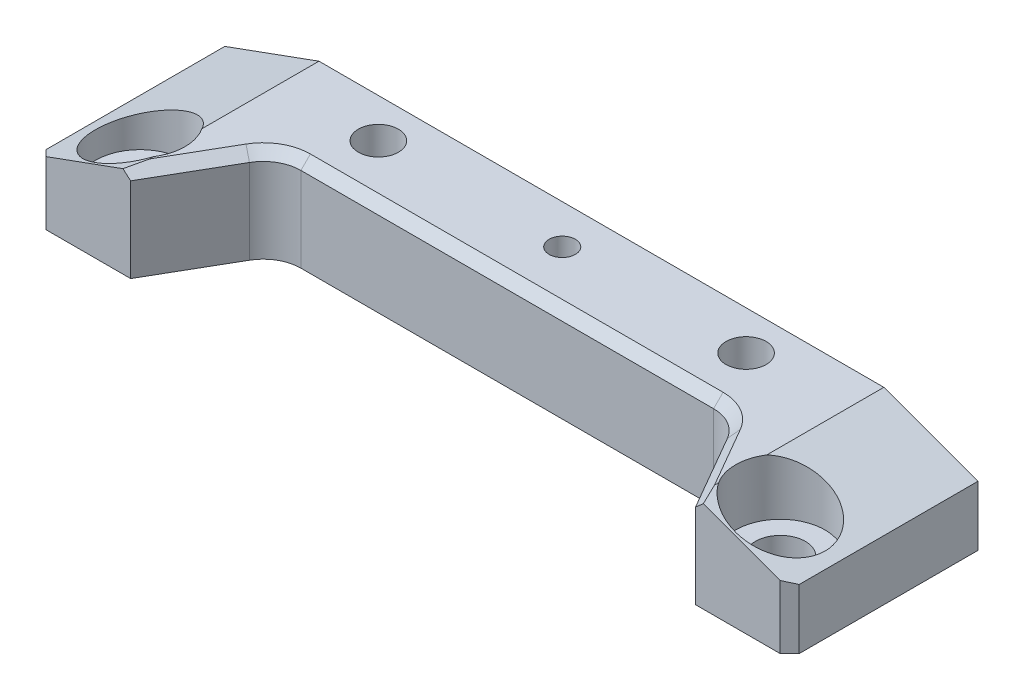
ISO-10303-21;
HEADER;
FILE_DESCRIPTION(('STEP AP214'),'2;1');
FILE_NAME('part.step','',(''),(''),'','','');
FILE_SCHEMA(('AUTOMOTIVE_DESIGN { 1 0 10303 214 1 1 1 1 }'));
ENDSEC;
DATA;
#1=APPLICATION_CONTEXT('core data for automotive mechanical design processes');
#2=APPLICATION_PROTOCOL_DEFINITION('international standard','automotive_design',2000,#1);
#3=PRODUCT_CONTEXT('',#1,'mechanical');
#4=PRODUCT('Part','Part','',(#3));
#5=PRODUCT_RELATED_PRODUCT_CATEGORY('part','',(#4));
#6=PRODUCT_DEFINITION_FORMATION('','',#4);
#7=PRODUCT_DEFINITION_CONTEXT('part definition',#1,'design');
#8=PRODUCT_DEFINITION('design','',#6,#7);
#9=PRODUCT_DEFINITION_SHAPE('','',#8);
#10=(LENGTH_UNIT() NAMED_UNIT(*) SI_UNIT(.MILLI.,.METRE.));
#11=(NAMED_UNIT(*) PLANE_ANGLE_UNIT() SI_UNIT($,.RADIAN.));
#12=(NAMED_UNIT(*) SI_UNIT($,.STERADIAN.) SOLID_ANGLE_UNIT());
#13=UNCERTAINTY_MEASURE_WITH_UNIT(LENGTH_MEASURE(1.E-05),#10,'distance_accuracy_value','');
#14=(GEOMETRIC_REPRESENTATION_CONTEXT(3) GLOBAL_UNCERTAINTY_ASSIGNED_CONTEXT((#13)) GLOBAL_UNIT_ASSIGNED_CONTEXT((#10,
#11,#12)) REPRESENTATION_CONTEXT('',''));
#15=CARTESIAN_POINT('',(0.,0.,0.));
#16=DIRECTION('',(0.,0.,1.));
#17=DIRECTION('',(1.,0.,0.));
#18=AXIS2_PLACEMENT_3D('',#15,#16,#17);
#19=CARTESIAN_POINT('',(0.,9.525,0.));
#20=DIRECTION('',(0.,1.,0.));
#21=DIRECTION('',(0.,0.,1.));
#22=AXIS2_PLACEMENT_3D('',#19,#20,#21);
#23=PLANE('',#22);
#24=CARTESIAN_POINT('',(0.,9.525,0.));
#25=DIRECTION('',(0.,1.,0.));
#26=DIRECTION('',(0.,0.,1.));
#27=AXIS2_PLACEMENT_3D('',#24,#25,#26);
#28=CIRCLE('',#27,2.21386533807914);
#29=CARTESIAN_POINT('',(0.,9.525,2.21386533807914));
#30=VERTEX_POINT('',#29);
#31=EDGE_CURVE('E19',#30,#30,#28,.T.);
#32=ORIENTED_EDGE('',*,*,#31,.T.);
#33=EDGE_LOOP('',(#32));
#34=FACE_BOUND('',#33,.T.);
#35=ADVANCED_FACE('F16',(#34),#23,.T.);
#36=CARTESIAN_POINT('',(0.,9.525,0.));
#37=DIRECTION('',(0.,1.,0.));
#38=DIRECTION('',(0.,0.,1.));
#39=AXIS2_PLACEMENT_3D('',#36,#37,#38);
#40=CYLINDRICAL_SURFACE('',#39,2.21386533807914);
#41=CARTESIAN_POINT('',(0.,15.875,0.));
#42=DIRECTION('',(0.,1.,0.));
#43=DIRECTION('',(0.,0.,1.));
#44=AXIS2_PLACEMENT_3D('',#41,#42,#43);
#45=CIRCLE('',#44,2.21386533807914);
#46=CARTESIAN_POINT('',(0.,15.875,2.21386533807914));
#47=VERTEX_POINT('',#46);
#48=EDGE_CURVE('E331',#47,#47,#45,.F.);
#49=ORIENTED_EDGE('',*,*,#48,.F.);
#50=EDGE_LOOP('',(#49));
#51=FACE_BOUND('',#50,.T.);
#52=ORIENTED_EDGE('',*,*,#31,.F.);
#53=EDGE_LOOP('',(#52));
#54=FACE_BOUND('',#53,.T.);
#55=ADVANCED_FACE('F585',(#51,#54),#40,.F.);
#56=CARTESIAN_POINT('',(-53.975,15.875,17.1958));
#57=DIRECTION('',(0.,1.,0.));
#58=DIRECTION('',(0.,0.,1.));
#59=AXIS2_PLACEMENT_3D('',#56,#57,#58);
#60=CYLINDRICAL_SURFACE('',#59,7.5438);
#61=CARTESIAN_POINT('',(-53.975,6.35,17.1958));
#62=DIRECTION('',(0.,1.,0.));
#63=DIRECTION('',(0.,0.,1.));
#64=AXIS2_PLACEMENT_3D('',#61,#62,#63);
#65=CIRCLE('',#64,7.5438);
#66=CARTESIAN_POINT('',(-53.975,6.35,24.7396));
#67=VERTEX_POINT('',#66);
#68=EDGE_CURVE('E328',#67,#67,#65,.F.);
#69=ORIENTED_EDGE('',*,*,#68,.T.);
#70=EDGE_LOOP('',(#69));
#71=FACE_BOUND('',#70,.T.);
#72=CARTESIAN_POINT('',(-53.975,15.875,17.1958));
#73=DIRECTION('',(0.,1.,0.));
#74=DIRECTION('',(0.,0.,1.));
#75=AXIS2_PLACEMENT_3D('',#72,#73,#74);
#76=CIRCLE('',#75,7.5438);
#77=CARTESIAN_POINT('',(-47.625,15.875,13.1231573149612));
#78=VERTEX_POINT('',#77);
#79=CARTESIAN_POINT('',(-47.625,15.875,21.2684426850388));
#80=VERTEX_POINT('',#79);
#81=EDGE_CURVE('E157',#78,#80,#76,.F.);
#82=ORIENTED_EDGE('',*,*,#81,.F.);
#83=CARTESIAN_POINT('',(-53.975,13.5637890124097,17.1958));
#84=DIRECTION('',(0.342020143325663,-0.93969262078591,0.));
#85=DIRECTION('',(0.93969262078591,0.342020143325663,0.));
#86=AXIS2_PLACEMENT_3D('',#83,#84,#85);
#87=ELLIPSE('',#86,8.02794428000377,7.5438);
#88=EDGE_CURVE('E145',#78,#80,#87,.F.);
#89=ORIENTED_EDGE('',*,*,#88,.T.);
#90=EDGE_LOOP('',(#82,#89));
#91=FACE_BOUND('',#90,.T.);
#92=ADVANCED_FACE('F158',(#71,#91),#60,.F.);
#93=CARTESIAN_POINT('',(53.975,15.875,17.1958));
#94=DIRECTION('',(0.,1.,0.));
#95=DIRECTION('',(0.,0.,1.));
#96=AXIS2_PLACEMENT_3D('',#93,#94,#95);
#97=CYLINDRICAL_SURFACE('',#96,7.5438);
#98=CARTESIAN_POINT('',(53.975,6.35,17.1958));
#99=DIRECTION('',(0.,1.,0.));
#100=DIRECTION('',(0.,0.,1.));
#101=AXIS2_PLACEMENT_3D('',#98,#99,#100);
#102=CIRCLE('',#101,7.5438);
#103=CARTESIAN_POINT('',(53.975,6.35,24.7396));
#104=VERTEX_POINT('',#103);
#105=EDGE_CURVE('E325',#104,#104,#102,.F.);
#106=ORIENTED_EDGE('',*,*,#105,.T.);
#107=EDGE_LOOP('',(#106));
#108=FACE_BOUND('',#107,.T.);
#109=CARTESIAN_POINT('',(53.975,15.875,17.1958));
#110=DIRECTION('',(0.,1.,0.));
#111=DIRECTION('',(0.,0.,1.));
#112=AXIS2_PLACEMENT_3D('',#109,#110,#111);
#113=CIRCLE('',#112,7.5438);
#114=CARTESIAN_POINT('',(47.625,15.875,21.2684426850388));
#115=VERTEX_POINT('',#114);
#116=CARTESIAN_POINT('',(47.625,15.875,13.1231573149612));
#117=VERTEX_POINT('',#116);
#118=EDGE_CURVE('E169',#115,#117,#113,.F.);
#119=ORIENTED_EDGE('',*,*,#118,.F.);
#120=CARTESIAN_POINT('',(53.975,13.5637890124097,17.1958));
#121=DIRECTION('',(-0.342020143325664,-0.93969262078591,0.));
#122=DIRECTION('',(-0.93969262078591,0.342020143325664,0.));
#123=AXIS2_PLACEMENT_3D('',#120,#121,#122);
#124=ELLIPSE('',#123,8.02794428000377,7.5438);
#125=EDGE_CURVE('E268',#115,#117,#124,.F.);
#126=ORIENTED_EDGE('',*,*,#125,.T.);
#127=EDGE_LOOP('',(#119,#126));
#128=FACE_BOUND('',#127,.T.);
#129=ADVANCED_FACE('F351',(#108,#128),#97,.F.);
#130=CARTESIAN_POINT('',(-31.0007,0.,0.));
#131=DIRECTION('',(0.,-1.,0.));
#132=DIRECTION('',(0.,0.,-1.));
#133=AXIS2_PLACEMENT_3D('',#130,#131,#132);
#134=CYLINDRICAL_SURFACE('',#133,3.3782);
#135=CARTESIAN_POINT('',(-31.0007,15.875,0.));
#136=DIRECTION('',(0.,-1.,0.));
#137=DIRECTION('',(0.,0.,-1.));
#138=AXIS2_PLACEMENT_3D('',#135,#136,#137);
#139=CIRCLE('',#138,3.3782);
#140=CARTESIAN_POINT('',(-31.0007,15.875,-3.37819999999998));
#141=VERTEX_POINT('',#140);
#142=EDGE_CURVE('E337',#141,#141,#139,.T.);
#143=ORIENTED_EDGE('',*,*,#142,.F.);
#144=EDGE_LOOP('',(#143));
#145=FACE_BOUND('',#144,.T.);
#146=CARTESIAN_POINT('',(-31.0007,9.525,0.));
#147=DIRECTION('',(0.,-1.,0.));
#148=DIRECTION('',(0.,0.,-1.));
#149=AXIS2_PLACEMENT_3D('',#146,#147,#148);
#150=CIRCLE('',#149,3.3782);
#151=CARTESIAN_POINT('',(-31.0007,9.525,-3.37819999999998));
#152=VERTEX_POINT('',#151);
#153=EDGE_CURVE('E322',#152,#152,#150,.T.);
#154=ORIENTED_EDGE('',*,*,#153,.T.);
#155=EDGE_LOOP('',(#154));
#156=FACE_BOUND('',#155,.T.);
#157=ADVANCED_FACE('F576',(#145,#156),#134,.F.);
#158=CARTESIAN_POINT('',(31.0007,0.,0.));
#159=DIRECTION('',(0.,-1.,0.));
#160=DIRECTION('',(0.,0.,-1.));
#161=AXIS2_PLACEMENT_3D('',#158,#159,#160);
#162=CYLINDRICAL_SURFACE('',#161,3.3782);
#163=CARTESIAN_POINT('',(31.0007,15.875,0.));
#164=DIRECTION('',(0.,-1.,0.));
#165=DIRECTION('',(0.,0.,-1.));
#166=AXIS2_PLACEMENT_3D('',#163,#164,#165);
#167=CIRCLE('',#166,3.3782);
#168=CARTESIAN_POINT('',(31.0007,15.875,-3.3782));
#169=VERTEX_POINT('',#168);
#170=EDGE_CURVE('E334',#169,#169,#167,.T.);
#171=ORIENTED_EDGE('',*,*,#170,.F.);
#172=EDGE_LOOP('',(#171));
#173=FACE_BOUND('',#172,.T.);
#174=CARTESIAN_POINT('',(31.0007,9.525,0.));
#175=DIRECTION('',(0.,-1.,0.));
#176=DIRECTION('',(0.,0.,-1.));
#177=AXIS2_PLACEMENT_3D('',#174,#175,#176);
#178=CIRCLE('',#177,3.3782);
#179=CARTESIAN_POINT('',(31.0007,9.525,-3.3782));
#180=VERTEX_POINT('',#179);
#181=EDGE_CURVE('E194',#180,#180,#178,.T.);
#182=ORIENTED_EDGE('',*,*,#181,.T.);
#183=EDGE_LOOP('',(#182));
#184=FACE_BOUND('',#183,.T.);
#185=ADVANCED_FACE('F573',(#173,#184),#162,.F.);
#186=CARTESIAN_POINT('',(38.4595644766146,14.2748,9.27099999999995));
#187=DIRECTION('',(-0.612372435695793,0.707106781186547,0.353553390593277));
#188=DIRECTION('',(-0.755928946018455,-0.654653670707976,0.));
#189=AXIS2_PLACEMENT_3D('',#186,#187,#188);
#190=PLANE('',#189);
#191=DIRECTION('',(-0.500000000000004,0.,-0.866025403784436));
#192=VECTOR('',#191,1.);
#193=CARTESIAN_POINT('',(38.4595644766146,14.2748,9.27099999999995));
#194=LINE('',#193,#192);
#195=CARTESIAN_POINT('',(40.2926515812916,14.2748,12.4459999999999));
#196=VERTEX_POINT('',#195);
#197=CARTESIAN_POINT('',(47.625,14.2748,25.146));
#198=VERTEX_POINT('',#197);
#199=EDGE_CURVE('E244',#196,#198,#194,.F.);
#200=ORIENTED_EDGE('',*,*,#199,.T.);
#201=DIRECTION('',(-0.755928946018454,-0.654653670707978,0.));
#202=VECTOR('',#201,1.);
#203=CARTESIAN_POINT('',(48.9259802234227,15.4014819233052,25.146));
#204=LINE('',#203,#202);
#205=CARTESIAN_POINT('',(48.9259802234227,15.4014819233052,25.146));
#206=VERTEX_POINT('',#205);
#207=EDGE_CURVE('E252',#206,#198,#204,.T.);
#208=ORIENTED_EDGE('',*,*,#207,.F.);
#209=DIRECTION('',(-0.373091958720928,0.13579436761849,-0.917802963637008));
#210=VECTOR('',#209,1.);
#211=CARTESIAN_POINT('',(48.9259802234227,15.4014819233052,25.146));
#212=LINE('',#211,#210);
#213=CARTESIAN_POINT('',(47.625,15.875,21.9456));
#214=VERTEX_POINT('',#213);
#215=EDGE_CURVE('E266',#206,#214,#212,.T.);
#216=ORIENTED_EDGE('',*,*,#215,.T.);
#217=DIRECTION('',(0.500000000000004,0.,0.866025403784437));
#218=VECTOR('',#217,1.);
#219=CARTESIAN_POINT('',(41.6784654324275,15.875,11.6458999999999));
#220=LINE('',#219,#218);
#221=CARTESIAN_POINT('',(41.6784654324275,15.875,11.6458999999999));
#222=VERTEX_POINT('',#221);
#223=EDGE_CURVE('E182',#222,#214,#220,.T.);
#224=ORIENTED_EDGE('',*,*,#223,.F.);
#225=DIRECTION('',(-0.612372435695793,-0.707106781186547,0.353553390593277));
#226=VECTOR('',#225,1.);
#227=CARTESIAN_POINT('',(41.6784654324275,15.875,11.6458999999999));
#228=LINE('',#227,#226);
#229=EDGE_CURVE('E241',#222,#196,#228,.T.);
#230=ORIENTED_EDGE('',*,*,#229,.T.);
#231=EDGE_LOOP('',(#200,#208,#216,#224,#230));
#232=FACE_BOUND('',#231,.T.);
#233=ADVANCED_FACE('F360',(#232),#190,.T.);
#234=CARTESIAN_POINT('',(34.7933902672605,15.875,15.6209999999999));
#235=DIRECTION('',(0.,1.,0.));
#236=DIRECTION('',(-1.,0.,0.));
#237=AXIS2_PLACEMENT_3D('',#234,#235,#236);
#238=CONICAL_SURFACE('',#237,7.9502,0.785398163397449);
#239=CARTESIAN_POINT('',(34.7933902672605,14.2748,15.6209999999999));
#240=DIRECTION('',(0.,-1.,0.));
#241=DIRECTION('',(0.,0.,-1.));
#242=AXIS2_PLACEMENT_3D('',#239,#240,#241);
#243=CIRCLE('',#242,6.35);
#244=CARTESIAN_POINT('',(34.7933902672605,14.2748,9.27099999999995));
#245=VERTEX_POINT('',#244);
#246=EDGE_CURVE('E233',#245,#196,#243,.T.);
#247=ORIENTED_EDGE('',*,*,#246,.T.);
#248=ORIENTED_EDGE('',*,*,#229,.F.);
#249=CARTESIAN_POINT('',(34.7933902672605,15.875,15.6209999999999));
#250=DIRECTION('',(0.,1.,0.));
#251=DIRECTION('',(-1.,0.,0.));
#252=AXIS2_PLACEMENT_3D('',#249,#250,#251);
#253=CIRCLE('',#252,7.9502);
#254=CARTESIAN_POINT('',(34.7933902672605,15.875,7.67079999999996));
#255=VERTEX_POINT('',#254);
#256=EDGE_CURVE('E187',#255,#222,#253,.F.);
#257=ORIENTED_EDGE('',*,*,#256,.F.);
#258=DIRECTION('',(0.,-0.707106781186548,0.707106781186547));
#259=VECTOR('',#258,1.);
#260=CARTESIAN_POINT('',(34.7933902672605,14.2748,9.27099999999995));
#261=LINE('',#260,#259);
#262=EDGE_CURVE('E230',#245,#255,#261,.F.);
#263=ORIENTED_EDGE('',*,*,#262,.F.);
#264=EDGE_LOOP('',(#247,#248,#257,#263));
#265=FACE_BOUND('',#264,.T.);
#266=ADVANCED_FACE('F418',(#265),#238,.F.);
#267=CARTESIAN_POINT('',(-38.4595644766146,14.2748,9.27099999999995));
#268=DIRECTION('',(0.,0.707106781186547,0.707106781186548));
#269=DIRECTION('',(0.,-0.707106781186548,0.707106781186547));
#270=AXIS2_PLACEMENT_3D('',#267,#268,#269);
#271=PLANE('',#270);
#272=ORIENTED_EDGE('',*,*,#262,.T.);
#273=DIRECTION('',(1.,0.,0.));
#274=VECTOR('',#273,1.);
#275=CARTESIAN_POINT('',(-63.5,15.875,7.67079999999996));
#276=LINE('',#275,#274);
#277=CARTESIAN_POINT('',(-34.7933902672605,15.875,7.67079999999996));
#278=VERTEX_POINT('',#277);
#279=EDGE_CURVE('E340',#278,#255,#276,.T.);
#280=ORIENTED_EDGE('',*,*,#279,.F.);
#281=DIRECTION('',(0.,-0.707106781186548,0.707106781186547));
#282=VECTOR('',#281,1.);
#283=CARTESIAN_POINT('',(-34.7933902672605,15.875,7.67079999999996));
#284=LINE('',#283,#282);
#285=CARTESIAN_POINT('',(-34.7933902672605,14.2748,9.27099999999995));
#286=VERTEX_POINT('',#285);
#287=EDGE_CURVE('E217',#278,#286,#284,.T.);
#288=ORIENTED_EDGE('',*,*,#287,.T.);
#289=DIRECTION('',(-1.,0.,0.));
#290=VECTOR('',#289,1.);
#291=CARTESIAN_POINT('',(-38.4595644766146,14.2748,9.27099999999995));
#292=LINE('',#291,#290);
#293=EDGE_CURVE('E223',#286,#245,#292,.F.);
#294=ORIENTED_EDGE('',*,*,#293,.T.);
#295=EDGE_LOOP('',(#272,#280,#288,#294));
#296=FACE_BOUND('',#295,.T.);
#297=ADVANCED_FACE('F416',(#296),#271,.T.);
#298=CARTESIAN_POINT('',(-34.7933902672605,15.875,15.621));
#299=DIRECTION('',(0.,1.,0.));
#300=DIRECTION('',(0.,0.,1.));
#301=AXIS2_PLACEMENT_3D('',#298,#299,#300);
#302=CONICAL_SURFACE('',#301,7.9502,0.785398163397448);
#303=CARTESIAN_POINT('',(-34.7933902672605,14.2748,15.621));
#304=DIRECTION('',(0.,-1.,0.));
#305=DIRECTION('',(0.,0.,-1.));
#306=AXIS2_PLACEMENT_3D('',#303,#304,#305);
#307=CIRCLE('',#306,6.35);
#308=CARTESIAN_POINT('',(-40.2926515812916,14.2748,12.4459999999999));
#309=VERTEX_POINT('',#308);
#310=EDGE_CURVE('E209',#309,#286,#307,.T.);
#311=ORIENTED_EDGE('',*,*,#310,.T.);
#312=ORIENTED_EDGE('',*,*,#287,.F.);
#313=CARTESIAN_POINT('',(-34.7933902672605,15.875,15.621));
#314=DIRECTION('',(0.,1.,0.));
#315=DIRECTION('',(0.,0.,1.));
#316=AXIS2_PLACEMENT_3D('',#313,#314,#315);
#317=CIRCLE('',#316,7.9502);
#318=CARTESIAN_POINT('',(-41.6784654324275,15.875,11.6458999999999));
#319=VERTEX_POINT('',#318);
#320=EDGE_CURVE('E341',#319,#278,#317,.F.);
#321=ORIENTED_EDGE('',*,*,#320,.F.);
#322=DIRECTION('',(-0.612372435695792,0.707106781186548,-0.353553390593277));
#323=VECTOR('',#322,1.);
#324=CARTESIAN_POINT('',(-40.2926515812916,14.2748,12.4459999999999));
#325=LINE('',#324,#323);
#326=EDGE_CURVE('E156',#309,#319,#325,.T.);
#327=ORIENTED_EDGE('',*,*,#326,.F.);
#328=EDGE_LOOP('',(#311,#312,#321,#327));
#329=FACE_BOUND('',#328,.T.);
#330=ADVANCED_FACE('F412',(#329),#302,.F.);
#331=CARTESIAN_POINT('',(-47.625,14.2748,25.146));
#332=DIRECTION('',(0.612372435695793,0.707106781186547,0.353553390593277));
#333=DIRECTION('',(-0.755928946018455,0.654653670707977,0.));
#334=AXIS2_PLACEMENT_3D('',#331,#332,#333);
#335=PLANE('',#334);
#336=DIRECTION('',(0.500000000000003,0.,-0.866025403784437));
#337=VECTOR('',#336,1.);
#338=CARTESIAN_POINT('',(-47.625,15.875,21.9456));
#339=LINE('',#338,#337);
#340=CARTESIAN_POINT('',(-47.625,15.875,21.9456));
#341=VERTEX_POINT('',#340);
#342=EDGE_CURVE('E342',#341,#319,#339,.T.);
#343=ORIENTED_EDGE('',*,*,#342,.F.);
#344=DIRECTION('',(-0.373091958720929,-0.135794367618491,0.917802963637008));
#345=VECTOR('',#344,1.);
#346=CARTESIAN_POINT('',(-47.625,15.875,21.9456000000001));
#347=LINE('',#346,#345);
#348=CARTESIAN_POINT('',(-48.9259802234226,15.4014819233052,25.146));
#349=VERTEX_POINT('',#348);
#350=EDGE_CURVE('E155',#341,#349,#347,.T.);
#351=ORIENTED_EDGE('',*,*,#350,.T.);
#352=DIRECTION('',(-0.755928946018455,0.654653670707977,0.));
#353=VECTOR('',#352,1.);
#354=CARTESIAN_POINT('',(-47.625,14.2748,25.146));
#355=LINE('',#354,#353);
#356=CARTESIAN_POINT('',(-47.625,14.2748,25.146));
#357=VERTEX_POINT('',#356);
#358=EDGE_CURVE('E215',#349,#357,#355,.F.);
#359=ORIENTED_EDGE('',*,*,#358,.T.);
#360=DIRECTION('',(-0.500000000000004,0.,0.866025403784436));
#361=VECTOR('',#360,1.);
#362=CARTESIAN_POINT('',(-47.625,14.2748,25.146));
#363=LINE('',#362,#361);
#364=EDGE_CURVE('E202',#357,#309,#363,.F.);
#365=ORIENTED_EDGE('',*,*,#364,.T.);
#366=ORIENTED_EDGE('',*,*,#326,.T.);
#367=EDGE_LOOP('',(#343,#351,#359,#365,#366));
#368=FACE_BOUND('',#367,.T.);
#369=ADVANCED_FACE('F407',(#368),#335,.T.);
#370=CARTESIAN_POINT('',(-63.5,10.0969725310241,-6.605));
#371=DIRECTION('',(0.342020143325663,-0.93969262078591,0.));
#372=DIRECTION('',(0.93969262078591,0.342020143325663,0.));
#373=AXIS2_PLACEMENT_3D('',#370,#371,#372);
#374=PLANE('',#373);
#375=ORIENTED_EDGE('',*,*,#350,.F.);
#376=DIRECTION('',(0.,0.,1.));
#377=VECTOR('',#376,1.);
#378=CARTESIAN_POINT('',(-47.625,15.875,-6.604));
#379=LINE('',#378,#377);
#380=EDGE_CURVE('E153',#80,#341,#379,.T.);
#381=ORIENTED_EDGE('',*,*,#380,.F.);
#382=ORIENTED_EDGE('',*,*,#88,.F.);
#383=DIRECTION('',(0.,0.,1.));
#384=VECTOR('',#383,1.);
#385=CARTESIAN_POINT('',(-47.625,15.875,-6.604));
#386=LINE('',#385,#384);
#387=CARTESIAN_POINT('',(-47.625,15.875,-6.604));
#388=VERTEX_POINT('',#387);
#389=EDGE_CURVE('E150',#388,#78,#386,.T.);
#390=ORIENTED_EDGE('',*,*,#389,.F.);
#391=DIRECTION('',(-0.93969262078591,-0.342020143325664,0.));
#392=VECTOR('',#391,1.);
#393=CARTESIAN_POINT('',(-47.625,15.875,-6.604));
#394=LINE('',#393,#392);
#395=CARTESIAN_POINT('',(-63.5,10.0969725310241,-6.604));
#396=VERTEX_POINT('',#395);
#397=EDGE_CURVE('E279',#388,#396,#394,.T.);
#398=ORIENTED_EDGE('',*,*,#397,.T.);
#399=DIRECTION('',(0.,0.,1.));
#400=VECTOR('',#399,1.);
#401=CARTESIAN_POINT('',(-63.5,10.0969725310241,-6.604));
#402=LINE('',#401,#400);
#403=CARTESIAN_POINT('',(-63.5,10.0969725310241,23.5458));
#404=VERTEX_POINT('',#403);
#405=EDGE_CURVE('E281',#404,#396,#402,.F.);
#406=ORIENTED_EDGE('',*,*,#405,.F.);
#407=DIRECTION('',(0.68479107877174,0.249243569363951,0.684791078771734));
#408=VECTOR('',#407,1.);
#409=CARTESIAN_POINT('',(-63.5,10.0969725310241,23.5458));
#410=LINE('',#409,#408);
#411=CARTESIAN_POINT('',(-61.8998,10.6793976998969,25.146));
#412=VERTEX_POINT('',#411);
#413=EDGE_CURVE('E450',#404,#412,#410,.T.);
#414=ORIENTED_EDGE('',*,*,#413,.T.);
#415=DIRECTION('',(-0.93969262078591,-0.342020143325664,0.));
#416=VECTOR('',#415,1.);
#417=CARTESIAN_POINT('',(-48.9259802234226,15.4014819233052,25.146));
#418=LINE('',#417,#416);
#419=EDGE_CURVE('E284',#349,#412,#418,.T.);
#420=ORIENTED_EDGE('',*,*,#419,.F.);
#421=EDGE_LOOP('',(#375,#381,#382,#390,#398,#406,#414,#420));
#422=FACE_BOUND('',#421,.T.);
#423=ADVANCED_FACE('F148',(#422),#374,.F.);
#424=CARTESIAN_POINT('',(47.625,15.875,-6.605));
#425=DIRECTION('',(-0.342020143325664,-0.93969262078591,0.));
#426=DIRECTION('',(0.93969262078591,-0.342020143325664,0.));
#427=AXIS2_PLACEMENT_3D('',#424,#425,#426);
#428=PLANE('',#427);
#429=ORIENTED_EDGE('',*,*,#215,.F.);
#430=DIRECTION('',(-0.93969262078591,0.342020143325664,0.));
#431=VECTOR('',#430,1.);
#432=CARTESIAN_POINT('',(61.8998,10.6793976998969,25.146));
#433=LINE('',#432,#431);
#434=CARTESIAN_POINT('',(61.8997999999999,10.6793976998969,25.146));
#435=VERTEX_POINT('',#434);
#436=EDGE_CURVE('E255',#435,#206,#433,.T.);
#437=ORIENTED_EDGE('',*,*,#436,.F.);
#438=DIRECTION('',(0.684791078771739,-0.249243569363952,-0.684791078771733));
#439=VECTOR('',#438,1.);
#440=CARTESIAN_POINT('',(61.8998,10.6793976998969,25.146));
#441=LINE('',#440,#439);
#442=CARTESIAN_POINT('',(63.5,10.0969725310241,23.5458));
#443=VERTEX_POINT('',#442);
#444=EDGE_CURVE('E193',#435,#443,#441,.T.);
#445=ORIENTED_EDGE('',*,*,#444,.T.);
#446=DIRECTION('',(0.,0.,-1.));
#447=VECTOR('',#446,1.);
#448=CARTESIAN_POINT('',(63.5,10.0969725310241,-6.604));
#449=LINE('',#448,#447);
#450=CARTESIAN_POINT('',(63.5,10.0969725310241,-6.604));
#451=VERTEX_POINT('',#450);
#452=EDGE_CURVE('E190',#451,#443,#449,.F.);
#453=ORIENTED_EDGE('',*,*,#452,.F.);
#454=DIRECTION('',(-0.93969262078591,0.342020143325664,0.));
#455=VECTOR('',#454,1.);
#456=CARTESIAN_POINT('',(63.5,10.0969725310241,-6.604));
#457=LINE('',#456,#455);
#458=CARTESIAN_POINT('',(47.625,15.875,-6.604));
#459=VERTEX_POINT('',#458);
#460=EDGE_CURVE('E197',#451,#459,#457,.T.);
#461=ORIENTED_EDGE('',*,*,#460,.T.);
#462=DIRECTION('',(0.,0.,1.));
#463=VECTOR('',#462,1.);
#464=CARTESIAN_POINT('',(47.625,15.875,-6.604));
#465=LINE('',#464,#463);
#466=EDGE_CURVE('E167',#117,#459,#465,.F.);
#467=ORIENTED_EDGE('',*,*,#466,.F.);
#468=ORIENTED_EDGE('',*,*,#125,.F.);
#469=DIRECTION('',(0.,0.,1.));
#470=VECTOR('',#469,1.);
#471=CARTESIAN_POINT('',(47.625,15.875,-6.604));
#472=LINE('',#471,#470);
#473=EDGE_CURVE('E179',#214,#115,#472,.F.);
#474=ORIENTED_EDGE('',*,*,#473,.F.);
#475=EDGE_LOOP('',(#429,#437,#445,#453,#461,#467,#468,#474));
#476=FACE_BOUND('',#475,.T.);
#477=ADVANCED_FACE('F354',(#476),#428,.F.);
#478=CARTESIAN_POINT('',(-63.5,15.875,-6.604));
#479=DIRECTION('',(0.,1.,0.));
#480=DIRECTION('',(0.,0.,1.));
#481=AXIS2_PLACEMENT_3D('',#478,#479,#480);
#482=PLANE('',#481);
#483=ORIENTED_EDGE('',*,*,#48,.T.);
#484=EDGE_LOOP('',(#483));
#485=FACE_BOUND('',#484,.T.);
#486=ORIENTED_EDGE('',*,*,#170,.T.);
#487=EDGE_LOOP('',(#486));
#488=FACE_BOUND('',#487,.T.);
#489=ORIENTED_EDGE('',*,*,#142,.T.);
#490=EDGE_LOOP('',(#489));
#491=FACE_BOUND('',#490,.T.);
#492=ORIENTED_EDGE('',*,*,#320,.T.);
#493=ORIENTED_EDGE('',*,*,#279,.T.);
#494=ORIENTED_EDGE('',*,*,#256,.T.);
#495=ORIENTED_EDGE('',*,*,#223,.T.);
#496=ORIENTED_EDGE('',*,*,#473,.T.);
#497=ORIENTED_EDGE('',*,*,#118,.T.);
#498=ORIENTED_EDGE('',*,*,#466,.T.);
#499=DIRECTION('',(1.,0.,0.));
#500=VECTOR('',#499,1.);
#501=CARTESIAN_POINT('',(0.,15.875,-6.604));
#502=LINE('',#501,#500);
#503=EDGE_CURVE('E165',#459,#388,#502,.F.);
#504=ORIENTED_EDGE('',*,*,#503,.T.);
#505=ORIENTED_EDGE('',*,*,#389,.T.);
#506=ORIENTED_EDGE('',*,*,#81,.T.);
#507=ORIENTED_EDGE('',*,*,#380,.T.);
#508=ORIENTED_EDGE('',*,*,#342,.T.);
#509=EDGE_LOOP('',(#492,#493,#494,#495,#496,#497,#498,#504,#505,#506,#507,#508));
#510=FACE_BOUND('',#509,.T.);
#511=ADVANCED_FACE('F162',(#485,#488,#491,#510),#482,.T.);
#512=CARTESIAN_POINT('',(-49.7586,6.35,17.1958));
#513=DIRECTION('',(0.,-1.,0.));
#514=DIRECTION('',(0.,0.,-1.));
#515=AXIS2_PLACEMENT_3D('',#512,#513,#514);
#516=PLANE('',#515);
#517=ORIENTED_EDGE('',*,*,#68,.F.);
#518=EDGE_LOOP('',(#517));
#519=FACE_BOUND('',#518,.T.);
#520=CARTESIAN_POINT('',(-53.975,6.35,17.1958));
#521=DIRECTION('',(0.,1.,0.));
#522=DIRECTION('',(0.,0.,1.));
#523=AXIS2_PLACEMENT_3D('',#520,#521,#522);
#524=CIRCLE('',#523,4.21639999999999);
#525=CARTESIAN_POINT('',(-53.975,6.35,21.4122));
#526=VERTEX_POINT('',#525);
#527=EDGE_CURVE('E276',#526,#526,#524,.F.);
#528=ORIENTED_EDGE('',*,*,#527,.T.);
#529=EDGE_LOOP('',(#528));
#530=FACE_BOUND('',#529,.T.);
#531=ADVANCED_FACE('F551',(#519,#530),#516,.F.);
#532=CARTESIAN_POINT('',(58.1914,6.35,17.1958));
#533=DIRECTION('',(0.,-1.,0.));
#534=DIRECTION('',(0.,0.,-1.));
#535=AXIS2_PLACEMENT_3D('',#532,#533,#534);
#536=PLANE('',#535);
#537=ORIENTED_EDGE('',*,*,#105,.F.);
#538=EDGE_LOOP('',(#537));
#539=FACE_BOUND('',#538,.T.);
#540=CARTESIAN_POINT('',(53.975,6.35,17.1958));
#541=DIRECTION('',(0.,1.,0.));
#542=DIRECTION('',(0.,0.,1.));
#543=AXIS2_PLACEMENT_3D('',#540,#541,#542);
#544=CIRCLE('',#543,4.21639999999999);
#545=CARTESIAN_POINT('',(53.975,6.35,21.4122));
#546=VERTEX_POINT('',#545);
#547=EDGE_CURVE('E315',#546,#546,#544,.F.);
#548=ORIENTED_EDGE('',*,*,#547,.T.);
#549=EDGE_LOOP('',(#548));
#550=FACE_BOUND('',#549,.T.);
#551=ADVANCED_FACE('F547',(#539,#550),#536,.F.);
#552=CARTESIAN_POINT('',(-27.6225,9.525,0.));
#553=DIRECTION('',(0.,1.,0.));
#554=DIRECTION('',(0.,0.,1.));
#555=AXIS2_PLACEMENT_3D('',#552,#553,#554);
#556=PLANE('',#555);
#557=CARTESIAN_POINT('',(-31.0007,9.525,0.));
#558=DIRECTION('',(0.,-1.,0.));
#559=DIRECTION('',(0.,0.,-1.));
#560=AXIS2_PLACEMENT_3D('',#557,#558,#559);
#561=CIRCLE('',#560,6.1468);
#562=CARTESIAN_POINT('',(-31.0007,9.525,-6.14679999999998));
#563=VERTEX_POINT('',#562);
#564=EDGE_CURVE('E312',#563,#563,#561,.T.);
#565=ORIENTED_EDGE('',*,*,#564,.T.);
#566=EDGE_LOOP('',(#565));
#567=FACE_BOUND('',#566,.T.);
#568=ORIENTED_EDGE('',*,*,#153,.F.);
#569=EDGE_LOOP('',(#568));
#570=FACE_BOUND('',#569,.T.);
#571=ADVANCED_FACE('F543',(#567,#570),#556,.F.);
#572=CARTESIAN_POINT('',(34.3789,9.525,0.));
#573=DIRECTION('',(0.,1.,0.));
#574=DIRECTION('',(0.,0.,1.));
#575=AXIS2_PLACEMENT_3D('',#572,#573,#574);
#576=PLANE('',#575);
#577=CARTESIAN_POINT('',(31.0007,9.525,0.));
#578=DIRECTION('',(0.,-1.,0.));
#579=DIRECTION('',(0.,0.,-1.));
#580=AXIS2_PLACEMENT_3D('',#577,#578,#579);
#581=CIRCLE('',#580,6.1468);
#582=CARTESIAN_POINT('',(31.0007,9.525,-6.1468));
#583=VERTEX_POINT('',#582);
#584=EDGE_CURVE('E308',#583,#583,#581,.T.);
#585=ORIENTED_EDGE('',*,*,#584,.T.);
#586=EDGE_LOOP('',(#585));
#587=FACE_BOUND('',#586,.T.);
#588=ORIENTED_EDGE('',*,*,#181,.F.);
#589=EDGE_LOOP('',(#588));
#590=FACE_BOUND('',#589,.T.);
#591=ADVANCED_FACE('F539',(#587,#590),#576,.F.);
#592=CARTESIAN_POINT('',(63.5,15.875,-6.604));
#593=DIRECTION('',(1.,0.,0.));
#594=DIRECTION('',(0.,0.,-1.));
#595=AXIS2_PLACEMENT_3D('',#592,#593,#594);
#596=PLANE('',#595);
#597=DIRECTION('',(0.,0.,-1.));
#598=VECTOR('',#597,1.);
#599=CARTESIAN_POINT('',(63.5,0.,-6.604));
#600=LINE('',#599,#598);
#601=CARTESIAN_POINT('',(63.5,0.,-6.604));
#602=VERTEX_POINT('',#601);
#603=CARTESIAN_POINT('',(63.5,0.,23.5458));
#604=VERTEX_POINT('',#603);
#605=EDGE_CURVE('E311',#602,#604,#600,.F.);
#606=ORIENTED_EDGE('',*,*,#605,.F.);
#607=DIRECTION('',(0.,1.,0.));
#608=VECTOR('',#607,1.);
#609=CARTESIAN_POINT('',(63.5,0.,-6.604));
#610=LINE('',#609,#608);
#611=EDGE_CURVE('E199',#602,#451,#610,.T.);
#612=ORIENTED_EDGE('',*,*,#611,.T.);
#613=ORIENTED_EDGE('',*,*,#452,.T.);
#614=DIRECTION('',(0.,1.,0.));
#615=VECTOR('',#614,1.);
#616=CARTESIAN_POINT('',(63.5,0.,23.5458));
#617=LINE('',#616,#615);
#618=EDGE_CURVE('E259',#443,#604,#617,.F.);
#619=ORIENTED_EDGE('',*,*,#618,.T.);
#620=EDGE_LOOP('',(#606,#612,#613,#619));
#621=FACE_BOUND('',#620,.T.);
#622=ADVANCED_FACE('F536',(#621),#596,.T.);
#623=CARTESIAN_POINT('',(61.8998,0.,25.146));
#624=DIRECTION('',(-0.707106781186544,0.,-0.707106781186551));
#625=DIRECTION('',(-0.707106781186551,0.,0.707106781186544));
#626=AXIS2_PLACEMENT_3D('',#623,#624,#625);
#627=PLANE('',#626);
#628=ORIENTED_EDGE('',*,*,#618,.F.);
#629=ORIENTED_EDGE('',*,*,#444,.F.);
#630=DIRECTION('',(0.,1.,0.));
#631=VECTOR('',#630,1.);
#632=CARTESIAN_POINT('',(61.8997999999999,0.,25.146));
#633=LINE('',#632,#631);
#634=CARTESIAN_POINT('',(61.8997999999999,0.,25.146));
#635=VERTEX_POINT('',#634);
#636=EDGE_CURVE('E246',#635,#435,#633,.T.);
#637=ORIENTED_EDGE('',*,*,#636,.F.);
#638=DIRECTION('',(-0.707106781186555,0.,0.70710678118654));
#639=VECTOR('',#638,1.);
#640=CARTESIAN_POINT('',(63.5,0.,23.5457999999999));
#641=LINE('',#640,#639);
#642=EDGE_CURVE('E379',#604,#635,#641,.T.);
#643=ORIENTED_EDGE('',*,*,#642,.F.);
#644=EDGE_LOOP('',(#628,#629,#637,#643));
#645=FACE_BOUND('',#644,.T.);
#646=ADVANCED_FACE('F533',(#645),#627,.F.);
#647=CARTESIAN_POINT('',(0.,0.,25.146));
#648=DIRECTION('',(0.,0.,1.));
#649=DIRECTION('',(1.,0.,0.));
#650=AXIS2_PLACEMENT_3D('',#647,#648,#649);
#651=PLANE('',#650);
#652=DIRECTION('',(1.,0.,0.));
#653=VECTOR('',#652,1.);
#654=CARTESIAN_POINT('',(-63.5,0.,25.146));
#655=LINE('',#654,#653);
#656=CARTESIAN_POINT('',(47.625,0.,25.146));
#657=VERTEX_POINT('',#656);
#658=EDGE_CURVE('E368',#635,#657,#655,.F.);
#659=ORIENTED_EDGE('',*,*,#658,.F.);
#660=ORIENTED_EDGE('',*,*,#636,.T.);
#661=ORIENTED_EDGE('',*,*,#436,.T.);
#662=ORIENTED_EDGE('',*,*,#207,.T.);
#663=DIRECTION('',(0.,1.,0.));
#664=VECTOR('',#663,1.);
#665=CARTESIAN_POINT('',(47.625,-0.001000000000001,25.146));
#666=LINE('',#665,#664);
#667=EDGE_CURVE('E236',#198,#657,#666,.F.);
#668=ORIENTED_EDGE('',*,*,#667,.T.);
#669=EDGE_LOOP('',(#659,#660,#661,#662,#668));
#670=FACE_BOUND('',#669,.T.);
#671=ADVANCED_FACE('F366',(#670),#651,.T.);
#672=CARTESIAN_POINT('',(38.4595644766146,-0.001000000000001,9.27099999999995));
#673=DIRECTION('',(0.866025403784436,0.,-0.500000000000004));
#674=DIRECTION('',(-0.500000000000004,0.,-0.866025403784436));
#675=AXIS2_PLACEMENT_3D('',#672,#673,#674);
#676=PLANE('',#675);
#677=ORIENTED_EDGE('',*,*,#199,.F.);
#678=DIRECTION('',(0.,-1.,0.));
#679=VECTOR('',#678,1.);
#680=CARTESIAN_POINT('',(40.2926515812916,-0.001000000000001,12.4459999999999));
#681=LINE('',#680,#679);
#682=CARTESIAN_POINT('',(40.2926515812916,0.,12.4459999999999));
#683=VERTEX_POINT('',#682);
#684=EDGE_CURVE('E226',#196,#683,#681,.T.);
#685=ORIENTED_EDGE('',*,*,#684,.T.);
#686=DIRECTION('',(-0.500000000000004,0.,-0.866025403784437));
#687=VECTOR('',#686,1.);
#688=CARTESIAN_POINT('',(47.625,0.,25.146));
#689=LINE('',#688,#687);
#690=EDGE_CURVE('E307',#657,#683,#689,.T.);
#691=ORIENTED_EDGE('',*,*,#690,.F.);
#692=ORIENTED_EDGE('',*,*,#667,.F.);
#693=EDGE_LOOP('',(#677,#685,#691,#692));
#694=FACE_BOUND('',#693,.T.);
#695=ADVANCED_FACE('F424',(#694),#676,.F.);
#696=CARTESIAN_POINT('',(34.7933902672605,-0.001000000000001,15.6209999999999));
#697=DIRECTION('',(0.,-1.,0.));
#698=DIRECTION('',(0.,0.,-1.));
#699=AXIS2_PLACEMENT_3D('',#696,#697,#698);
#700=CYLINDRICAL_SURFACE('',#699,6.35);
#701=ORIENTED_EDGE('',*,*,#246,.F.);
#702=DIRECTION('',(0.,1.,0.));
#703=VECTOR('',#702,1.);
#704=CARTESIAN_POINT('',(34.7933902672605,-0.001000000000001,9.27099999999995));
#705=LINE('',#704,#703);
#706=CARTESIAN_POINT('',(34.7933902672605,0.,9.27099999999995));
#707=VERTEX_POINT('',#706);
#708=EDGE_CURVE('E212',#245,#707,#705,.F.);
#709=ORIENTED_EDGE('',*,*,#708,.T.);
#710=CARTESIAN_POINT('',(34.7933902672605,0.,15.6209999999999));
#711=DIRECTION('',(0.,-1.,0.));
#712=DIRECTION('',(0.,0.,-1.));
#713=AXIS2_PLACEMENT_3D('',#710,#711,#712);
#714=CIRCLE('',#713,6.35);
#715=EDGE_CURVE('E304',#683,#707,#714,.F.);
#716=ORIENTED_EDGE('',*,*,#715,.F.);
#717=ORIENTED_EDGE('',*,*,#684,.F.);
#718=EDGE_LOOP('',(#701,#709,#716,#717));
#719=FACE_BOUND('',#718,.T.);
#720=ADVANCED_FACE('F427',(#719),#700,.F.);
#721=CARTESIAN_POINT('',(-38.4595644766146,-0.001000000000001,9.27099999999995));
#722=DIRECTION('',(0.,0.,-1.));
#723=DIRECTION('',(-1.,0.,0.));
#724=AXIS2_PLACEMENT_3D('',#721,#722,#723);
#725=PLANE('',#724);
#726=ORIENTED_EDGE('',*,*,#293,.F.);
#727=DIRECTION('',(0.,-1.,0.));
#728=VECTOR('',#727,1.);
#729=CARTESIAN_POINT('',(-34.7933902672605,-0.001000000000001,9.27099999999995));
#730=LINE('',#729,#728);
#731=CARTESIAN_POINT('',(-34.7933902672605,0.,9.27099999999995));
#732=VERTEX_POINT('',#731);
#733=EDGE_CURVE('E206',#286,#732,#730,.T.);
#734=ORIENTED_EDGE('',*,*,#733,.T.);
#735=DIRECTION('',(1.,0.,0.));
#736=VECTOR('',#735,1.);
#737=CARTESIAN_POINT('',(-63.5,0.,9.27099999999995));
#738=LINE('',#737,#736);
#739=EDGE_CURVE('E303',#707,#732,#738,.F.);
#740=ORIENTED_EDGE('',*,*,#739,.F.);
#741=ORIENTED_EDGE('',*,*,#708,.F.);
#742=EDGE_LOOP('',(#726,#734,#740,#741));
#743=FACE_BOUND('',#742,.T.);
#744=ADVANCED_FACE('F472',(#743),#725,.F.);
#745=CARTESIAN_POINT('',(-34.7933902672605,-0.001000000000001,15.621));
#746=DIRECTION('',(0.,-1.,0.));
#747=DIRECTION('',(0.,0.,-1.));
#748=AXIS2_PLACEMENT_3D('',#745,#746,#747);
#749=CYLINDRICAL_SURFACE('',#748,6.35);
#750=ORIENTED_EDGE('',*,*,#310,.F.);
#751=DIRECTION('',(0.,1.,0.));
#752=VECTOR('',#751,1.);
#753=CARTESIAN_POINT('',(-40.2926515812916,-0.001000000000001,12.4459999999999));
#754=LINE('',#753,#752);
#755=CARTESIAN_POINT('',(-40.2926515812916,0.,12.4459999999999));
#756=VERTEX_POINT('',#755);
#757=EDGE_CURVE('E205',#309,#756,#754,.F.);
#758=ORIENTED_EDGE('',*,*,#757,.T.);
#759=CARTESIAN_POINT('',(-34.7933902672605,0.,15.621));
#760=DIRECTION('',(0.,-1.,0.));
#761=DIRECTION('',(0.,0.,-1.));
#762=AXIS2_PLACEMENT_3D('',#759,#760,#761);
#763=CIRCLE('',#762,6.35);
#764=EDGE_CURVE('E299',#732,#756,#763,.F.);
#765=ORIENTED_EDGE('',*,*,#764,.F.);
#766=ORIENTED_EDGE('',*,*,#733,.F.);
#767=EDGE_LOOP('',(#750,#758,#765,#766));
#768=FACE_BOUND('',#767,.T.);
#769=ADVANCED_FACE('F520',(#768),#749,.F.);
#770=CARTESIAN_POINT('',(-47.625,-0.001000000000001,25.146));
#771=DIRECTION('',(-0.866025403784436,0.,-0.500000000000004));
#772=DIRECTION('',(-0.500000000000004,0.,0.866025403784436));
#773=AXIS2_PLACEMENT_3D('',#770,#771,#772);
#774=PLANE('',#773);
#775=ORIENTED_EDGE('',*,*,#364,.F.);
#776=DIRECTION('',(0.,1.,0.));
#777=VECTOR('',#776,1.);
#778=CARTESIAN_POINT('',(-47.625,0.,25.146));
#779=LINE('',#778,#777);
#780=CARTESIAN_POINT('',(-47.625,0.,25.146));
#781=VERTEX_POINT('',#780);
#782=EDGE_CURVE('E287',#781,#357,#779,.T.);
#783=ORIENTED_EDGE('',*,*,#782,.F.);
#784=DIRECTION('',(-0.500000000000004,0.,0.866025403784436));
#785=VECTOR('',#784,1.);
#786=CARTESIAN_POINT('',(-40.2926515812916,0.,12.4459999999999));
#787=LINE('',#786,#785);
#788=EDGE_CURVE('E302',#756,#781,#787,.T.);
#789=ORIENTED_EDGE('',*,*,#788,.F.);
#790=ORIENTED_EDGE('',*,*,#757,.F.);
#791=EDGE_LOOP('',(#775,#783,#789,#790));
#792=FACE_BOUND('',#791,.T.);
#793=ADVANCED_FACE('F516',(#792),#774,.F.);
#794=CARTESIAN_POINT('',(0.,0.,25.146));
#795=DIRECTION('',(0.,0.,1.));
#796=DIRECTION('',(1.,0.,0.));
#797=AXIS2_PLACEMENT_3D('',#794,#795,#796);
#798=PLANE('',#797);
#799=DIRECTION('',(0.,1.,0.));
#800=VECTOR('',#799,1.);
#801=CARTESIAN_POINT('',(-61.8998,0.,25.146));
#802=LINE('',#801,#800);
#803=CARTESIAN_POINT('',(-61.8998,0.,25.146));
#804=VERTEX_POINT('',#803);
#805=EDGE_CURVE('E286',#412,#804,#802,.F.);
#806=ORIENTED_EDGE('',*,*,#805,.T.);
#807=DIRECTION('',(1.,0.,0.));
#808=VECTOR('',#807,1.);
#809=CARTESIAN_POINT('',(-63.5,0.,25.146));
#810=LINE('',#809,#808);
#811=EDGE_CURVE('E457',#781,#804,#810,.F.);
#812=ORIENTED_EDGE('',*,*,#811,.F.);
#813=ORIENTED_EDGE('',*,*,#782,.T.);
#814=ORIENTED_EDGE('',*,*,#358,.F.);
#815=ORIENTED_EDGE('',*,*,#419,.T.);
#816=EDGE_LOOP('',(#806,#812,#813,#814,#815));
#817=FACE_BOUND('',#816,.T.);
#818=ADVANCED_FACE('F512',(#817),#798,.T.);
#819=CARTESIAN_POINT('',(-61.8998,0.,25.146));
#820=DIRECTION('',(0.707106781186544,0.,-0.707106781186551));
#821=DIRECTION('',(-0.707106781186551,0.,-0.707106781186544));
#822=AXIS2_PLACEMENT_3D('',#819,#820,#821);
#823=PLANE('',#822);
#824=DIRECTION('',(0.,1.,0.));
#825=VECTOR('',#824,1.);
#826=CARTESIAN_POINT('',(-63.5,15.875,23.5458));
#827=LINE('',#826,#825);
#828=CARTESIAN_POINT('',(-63.5,0.,23.5458));
#829=VERTEX_POINT('',#828);
#830=EDGE_CURVE('E447',#829,#404,#827,.T.);
#831=ORIENTED_EDGE('',*,*,#830,.F.);
#832=DIRECTION('',(-0.707106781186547,0.,-0.707106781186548));
#833=VECTOR('',#832,1.);
#834=CARTESIAN_POINT('',(-61.8998,0.,25.146));
#835=LINE('',#834,#833);
#836=EDGE_CURVE('E460',#804,#829,#835,.T.);
#837=ORIENTED_EDGE('',*,*,#836,.F.);
#838=ORIENTED_EDGE('',*,*,#805,.F.);
#839=ORIENTED_EDGE('',*,*,#413,.F.);
#840=EDGE_LOOP('',(#831,#837,#838,#839));
#841=FACE_BOUND('',#840,.T.);
#842=ADVANCED_FACE('F509',(#841),#823,.F.);
#843=CARTESIAN_POINT('',(-63.5,15.875,-6.604));
#844=DIRECTION('',(-1.,0.,0.));
#845=DIRECTION('',(0.,0.,1.));
#846=AXIS2_PLACEMENT_3D('',#843,#844,#845);
#847=PLANE('',#846);
#848=ORIENTED_EDGE('',*,*,#405,.T.);
#849=DIRECTION('',(0.,1.,0.));
#850=VECTOR('',#849,1.);
#851=CARTESIAN_POINT('',(-63.5,0.,-6.604));
#852=LINE('',#851,#850);
#853=CARTESIAN_POINT('',(-63.5,0.,-6.604));
#854=VERTEX_POINT('',#853);
#855=EDGE_CURVE('E34',#396,#854,#852,.F.);
#856=ORIENTED_EDGE('',*,*,#855,.T.);
#857=DIRECTION('',(0.,0.,-1.));
#858=VECTOR('',#857,1.);
#859=CARTESIAN_POINT('',(-63.5,0.,-6.604));
#860=LINE('',#859,#858);
#861=EDGE_CURVE('E396',#829,#854,#860,.T.);
#862=ORIENTED_EDGE('',*,*,#861,.F.);
#863=ORIENTED_EDGE('',*,*,#830,.T.);
#864=EDGE_LOOP('',(#848,#856,#862,#863));
#865=FACE_BOUND('',#864,.T.);
#866=ADVANCED_FACE('F505',(#865),#847,.T.);
#867=CARTESIAN_POINT('',(0.,0.,-6.604));
#868=DIRECTION('',(0.,0.,1.));
#869=DIRECTION('',(1.,0.,0.));
#870=AXIS2_PLACEMENT_3D('',#867,#868,#869);
#871=PLANE('',#870);
#872=ORIENTED_EDGE('',*,*,#460,.F.);
#873=ORIENTED_EDGE('',*,*,#611,.F.);
#874=DIRECTION('',(1.,0.,0.));
#875=VECTOR('',#874,1.);
#876=CARTESIAN_POINT('',(-63.5,0.,-6.604));
#877=LINE('',#876,#875);
#878=EDGE_CURVE('E298',#854,#602,#877,.T.);
#879=ORIENTED_EDGE('',*,*,#878,.F.);
#880=ORIENTED_EDGE('',*,*,#855,.F.);
#881=ORIENTED_EDGE('',*,*,#397,.F.);
#882=ORIENTED_EDGE('',*,*,#503,.F.);
#883=EDGE_LOOP('',(#872,#873,#879,#880,#881,#882));
#884=FACE_BOUND('',#883,.T.);
#885=ADVANCED_FACE('F501',(#884),#871,.F.);
#886=CARTESIAN_POINT('',(-53.975,15.875,17.1958));
#887=DIRECTION('',(0.,1.,0.));
#888=DIRECTION('',(0.,0.,1.));
#889=AXIS2_PLACEMENT_3D('',#886,#887,#888);
#890=CYLINDRICAL_SURFACE('',#889,4.21639999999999);
#891=CARTESIAN_POINT('',(-53.975,0.,17.1958));
#892=DIRECTION('',(0.,1.,0.));
#893=DIRECTION('',(0.,0.,1.));
#894=AXIS2_PLACEMENT_3D('',#891,#892,#893);
#895=CIRCLE('',#894,4.21639999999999);
#896=CARTESIAN_POINT('',(-53.975,0.,21.4122));
#897=VERTEX_POINT('',#896);
#898=EDGE_CURVE('E295',#897,#897,#895,.T.);
#899=ORIENTED_EDGE('',*,*,#898,.F.);
#900=EDGE_LOOP('',(#899));
#901=FACE_BOUND('',#900,.T.);
#902=ORIENTED_EDGE('',*,*,#527,.F.);
#903=EDGE_LOOP('',(#902));
#904=FACE_BOUND('',#903,.T.);
#905=ADVANCED_FACE('F497',(#901,#904),#890,.F.);
#906=CARTESIAN_POINT('',(53.975,15.875,17.1958));
#907=DIRECTION('',(0.,1.,0.));
#908=DIRECTION('',(0.,0.,1.));
#909=AXIS2_PLACEMENT_3D('',#906,#907,#908);
#910=CYLINDRICAL_SURFACE('',#909,4.21639999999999);
#911=CARTESIAN_POINT('',(53.975,0.,17.1958));
#912=DIRECTION('',(0.,1.,0.));
#913=DIRECTION('',(0.,0.,1.));
#914=AXIS2_PLACEMENT_3D('',#911,#912,#913);
#915=CIRCLE('',#914,4.21639999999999);
#916=CARTESIAN_POINT('',(53.975,0.,21.4122));
#917=VERTEX_POINT('',#916);
#918=EDGE_CURVE('E292',#917,#917,#915,.T.);
#919=ORIENTED_EDGE('',*,*,#918,.F.);
#920=EDGE_LOOP('',(#919));
#921=FACE_BOUND('',#920,.T.);
#922=ORIENTED_EDGE('',*,*,#547,.F.);
#923=EDGE_LOOP('',(#922));
#924=FACE_BOUND('',#923,.T.);
#925=ADVANCED_FACE('F493',(#921,#924),#910,.F.);
#926=CARTESIAN_POINT('',(-31.0007,0.,0.));
#927=DIRECTION('',(0.,-1.,0.));
#928=DIRECTION('',(0.,0.,-1.));
#929=AXIS2_PLACEMENT_3D('',#926,#927,#928);
#930=CYLINDRICAL_SURFACE('',#929,6.1468);
#931=CARTESIAN_POINT('',(-31.0007,0.,0.));
#932=DIRECTION('',(0.,-1.,0.));
#933=DIRECTION('',(0.,0.,-1.));
#934=AXIS2_PLACEMENT_3D('',#931,#932,#933);
#935=CIRCLE('',#934,6.1468);
#936=CARTESIAN_POINT('',(-31.0007,0.,-6.14679999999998));
#937=VERTEX_POINT('',#936);
#938=EDGE_CURVE('E25',#937,#937,#935,.F.);
#939=ORIENTED_EDGE('',*,*,#938,.F.);
#940=EDGE_LOOP('',(#939));
#941=FACE_BOUND('',#940,.T.);
#942=ORIENTED_EDGE('',*,*,#564,.F.);
#943=EDGE_LOOP('',(#942));
#944=FACE_BOUND('',#943,.T.);
#945=ADVANCED_FACE('F486',(#941,#944),#930,.F.);
#946=CARTESIAN_POINT('',(31.0007,0.,0.));
#947=DIRECTION('',(0.,-1.,0.));
#948=DIRECTION('',(0.,0.,-1.));
#949=AXIS2_PLACEMENT_3D('',#946,#947,#948);
#950=CYLINDRICAL_SURFACE('',#949,6.1468);
#951=CARTESIAN_POINT('',(31.0007,0.,0.));
#952=DIRECTION('',(0.,-1.,0.));
#953=DIRECTION('',(0.,0.,-1.));
#954=AXIS2_PLACEMENT_3D('',#951,#952,#953);
#955=CIRCLE('',#954,6.1468);
#956=CARTESIAN_POINT('',(31.0007,0.,-6.1468));
#957=VERTEX_POINT('',#956);
#958=EDGE_CURVE('E11',#957,#957,#955,.F.);
#959=ORIENTED_EDGE('',*,*,#958,.F.);
#960=EDGE_LOOP('',(#959));
#961=FACE_BOUND('',#960,.T.);
#962=ORIENTED_EDGE('',*,*,#584,.F.);
#963=EDGE_LOOP('',(#962));
#964=FACE_BOUND('',#963,.T.);
#965=ADVANCED_FACE('F479',(#961,#964),#950,.F.);
#966=CARTESIAN_POINT('',(-63.5,0.,-6.604));
#967=DIRECTION('',(0.,-1.,0.));
#968=DIRECTION('',(0.,0.,-1.));
#969=AXIS2_PLACEMENT_3D('',#966,#967,#968);
#970=PLANE('',#969);
#971=ORIENTED_EDGE('',*,*,#958,.T.);
#972=EDGE_LOOP('',(#971));
#973=FACE_BOUND('',#972,.T.);
#974=ORIENTED_EDGE('',*,*,#938,.T.);
#975=EDGE_LOOP('',(#974));
#976=FACE_BOUND('',#975,.T.);
#977=ORIENTED_EDGE('',*,*,#918,.T.);
#978=EDGE_LOOP('',(#977));
#979=FACE_BOUND('',#978,.T.);
#980=ORIENTED_EDGE('',*,*,#898,.T.);
#981=EDGE_LOOP('',(#980));
#982=FACE_BOUND('',#981,.T.);
#983=ORIENTED_EDGE('',*,*,#861,.T.);
#984=ORIENTED_EDGE('',*,*,#878,.T.);
#985=ORIENTED_EDGE('',*,*,#605,.T.);
#986=ORIENTED_EDGE('',*,*,#642,.T.);
#987=ORIENTED_EDGE('',*,*,#658,.T.);
#988=ORIENTED_EDGE('',*,*,#690,.T.);
#989=ORIENTED_EDGE('',*,*,#715,.T.);
#990=ORIENTED_EDGE('',*,*,#739,.T.);
#991=ORIENTED_EDGE('',*,*,#764,.T.);
#992=ORIENTED_EDGE('',*,*,#788,.T.);
#993=ORIENTED_EDGE('',*,*,#811,.T.);
#994=ORIENTED_EDGE('',*,*,#836,.T.);
#995=EDGE_LOOP('',(#983,#984,#985,#986,#987,#988,#989,#990,#991,#992,#993,#994));
#996=FACE_BOUND('',#995,.T.);
#997=ADVANCED_FACE('F476',(#973,#976,#979,#982,#996),#970,.T.);
#998=CLOSED_SHELL('',(#35,#55,#92,#129,#157,#185,#233,#266,#297,#330,#369,#423,#477,#511,#531,
#551,#571,#591,#622,#646,#671,#695,#720,#744,#769,#793,#818,#842,#866,#885,#905,#925,#945,#965,#997));
#999=MANIFOLD_SOLID_BREP('B1',#998);
#1000=ADVANCED_BREP_SHAPE_REPRESENTATION('',(#18,#999),#14);
#1001=SHAPE_DEFINITION_REPRESENTATION(#9,#1000);
ENDSEC;
END-ISO-10303-21;
